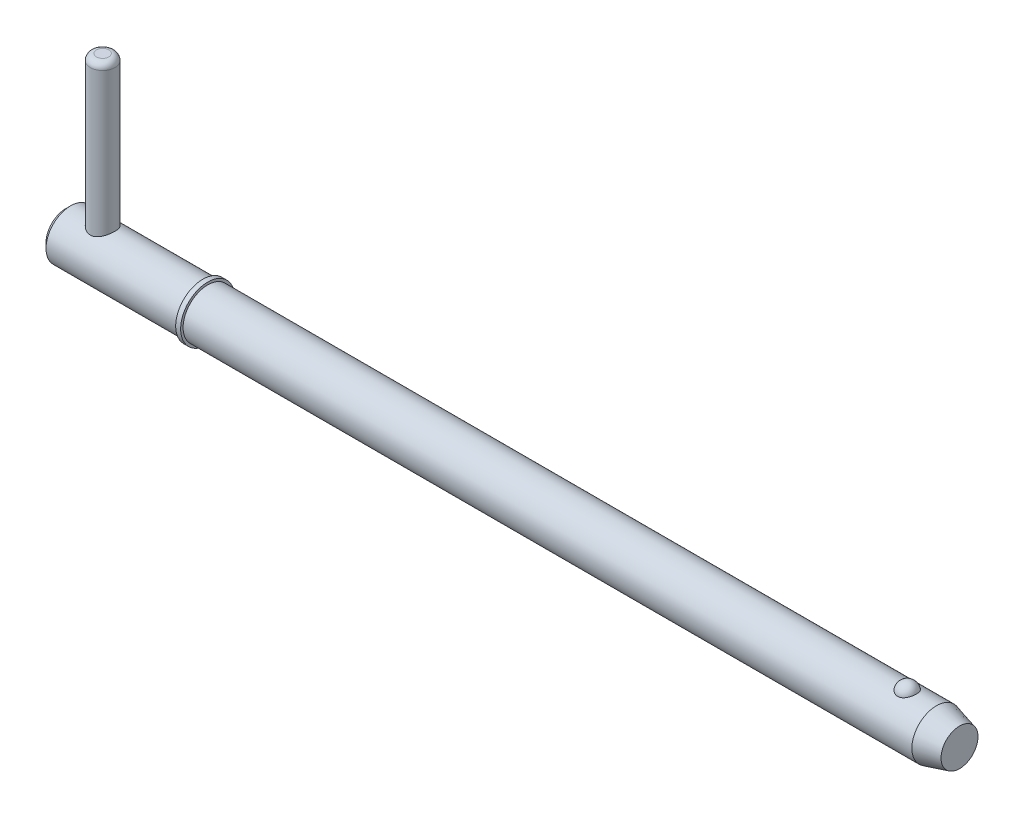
ISO-10303-21;
HEADER;
FILE_DESCRIPTION(('STEP AP214'),'2;1');
FILE_NAME('part.step','',(''),(''),'','','');
FILE_SCHEMA(('AUTOMOTIVE_DESIGN { 1 0 10303 214 1 1 1 1 }'));
ENDSEC;
DATA;
#1=APPLICATION_CONTEXT('core data for automotive mechanical design processes');
#2=APPLICATION_PROTOCOL_DEFINITION('international standard','automotive_design',2000,#1);
#3=PRODUCT_CONTEXT('',#1,'mechanical');
#4=PRODUCT('Part','Part','',(#3));
#5=PRODUCT_RELATED_PRODUCT_CATEGORY('part','',(#4));
#6=PRODUCT_DEFINITION_FORMATION('','',#4);
#7=PRODUCT_DEFINITION_CONTEXT('part definition',#1,'design');
#8=PRODUCT_DEFINITION('design','',#6,#7);
#9=PRODUCT_DEFINITION_SHAPE('','',#8);
#10=(LENGTH_UNIT() NAMED_UNIT(*) SI_UNIT(.MILLI.,.METRE.));
#11=(NAMED_UNIT(*) PLANE_ANGLE_UNIT() SI_UNIT($,.RADIAN.));
#12=(NAMED_UNIT(*) SI_UNIT($,.STERADIAN.) SOLID_ANGLE_UNIT());
#13=UNCERTAINTY_MEASURE_WITH_UNIT(LENGTH_MEASURE(1.E-05),#10,'distance_accuracy_value','');
#14=(GEOMETRIC_REPRESENTATION_CONTEXT(3) GLOBAL_UNCERTAINTY_ASSIGNED_CONTEXT((#13)) GLOBAL_UNIT_ASSIGNED_CONTEXT((#10,
#11,#12)) REPRESENTATION_CONTEXT('',''));
#15=CARTESIAN_POINT('',(0.,0.,0.));
#16=DIRECTION('',(0.,0.,1.));
#17=DIRECTION('',(1.,0.,0.));
#18=AXIS2_PLACEMENT_3D('',#15,#16,#17);
#19=CARTESIAN_POINT('',(4.755,22.225,0.));
#20=DIRECTION('',(0.,-1.,0.));
#21=DIRECTION('',(0.,0.,-1.));
#22=AXIS2_PLACEMENT_3D('',#19,#20,#21);
#23=CYLINDRICAL_SURFACE('',#22,1.585);
#24=CARTESIAN_POINT('',(4.755,-2.3825,0.));
#25=DIRECTION('',(0.,1.,0.));
#26=DIRECTION('',(0.,0.,1.));
#27=AXIS2_PLACEMENT_3D('',#24,#25,#26);
#28=CIRCLE('',#27,1.585);
#29=CARTESIAN_POINT('',(4.755,-2.3825,1.585));
#30=VERTEX_POINT('',#29);
#31=EDGE_CURVE('P0_E25',#30,#30,#28,.T.);
#32=ORIENTED_EDGE('',*,*,#31,.T.);
#33=EDGE_LOOP('',(#32));
#34=FACE_BOUND('',#33,.T.);
#35=CARTESIAN_POINT('',(4.755,21.4325,0.));
#36=DIRECTION('',(0.,1.,0.));
#37=DIRECTION('',(0.,0.,1.));
#38=AXIS2_PLACEMENT_3D('',#35,#36,#37);
#39=CIRCLE('',#38,1.585);
#40=CARTESIAN_POINT('',(4.755,21.4325,1.585));
#41=VERTEX_POINT('',#40);
#42=EDGE_CURVE('P0_E29',#41,#41,#39,.F.);
#43=ORIENTED_EDGE('',*,*,#42,.T.);
#44=EDGE_LOOP('',(#43));
#45=FACE_BOUND('',#44,.T.);
#46=ADVANCED_FACE('P0_F14',(#34,#45),#23,.T.);
#47=CARTESIAN_POINT('',(4.755,22.225,0.));
#48=DIRECTION('',(0.,1.,0.));
#49=DIRECTION('',(0.,0.,1.));
#50=AXIS2_PLACEMENT_3D('',#47,#48,#49);
#51=PLANE('',#50);
#52=CARTESIAN_POINT('',(4.755,22.225,0.));
#53=DIRECTION('',(0.,1.,0.));
#54=DIRECTION('',(0.,0.,1.));
#55=AXIS2_PLACEMENT_3D('',#52,#53,#54);
#56=CIRCLE('',#55,0.7925);
#57=CARTESIAN_POINT('',(4.755,22.225,0.7925));
#58=VERTEX_POINT('',#57);
#59=EDGE_CURVE('P0_E10',#58,#58,#56,.T.);
#60=ORIENTED_EDGE('',*,*,#59,.T.);
#61=EDGE_LOOP('',(#60));
#62=FACE_BOUND('',#61,.T.);
#63=ADVANCED_FACE('P0_F46',(#62),#51,.T.);
#64=CARTESIAN_POINT('',(4.755,-3.175,0.));
#65=DIRECTION('',(0.,1.,0.));
#66=DIRECTION('',(0.,0.,1.));
#67=AXIS2_PLACEMENT_3D('',#64,#65,#66);
#68=PLANE('',#67);
#69=CARTESIAN_POINT('',(4.755,-3.175,0.));
#70=DIRECTION('',(0.,1.,0.));
#71=DIRECTION('',(0.,0.,1.));
#72=AXIS2_PLACEMENT_3D('',#69,#70,#71);
#73=CIRCLE('',#72,0.7925);
#74=CARTESIAN_POINT('',(4.755,-3.175,0.7925));
#75=VERTEX_POINT('',#74);
#76=EDGE_CURVE('P0_E21',#75,#75,#73,.F.);
#77=ORIENTED_EDGE('',*,*,#76,.T.);
#78=EDGE_LOOP('',(#77));
#79=FACE_BOUND('',#78,.T.);
#80=ADVANCED_FACE('P0_F43',(#79),#68,.F.);
#81=CARTESIAN_POINT('',(4.755,-2.3825,0.));
#82=DIRECTION('',(0.,1.,0.));
#83=DIRECTION('',(0.,0.,1.));
#84=AXIS2_PLACEMENT_3D('',#81,#82,#83);
#85=DEGENERATE_TOROIDAL_SURFACE('',#84,0.7925,0.7925,.T.);
#86=ORIENTED_EDGE('',*,*,#76,.F.);
#87=EDGE_LOOP('',(#86));
#88=FACE_BOUND('',#87,.T.);
#89=ORIENTED_EDGE('',*,*,#31,.F.);
#90=EDGE_LOOP('',(#89));
#91=FACE_BOUND('',#90,.T.);
#92=ADVANCED_FACE('P0_F38',(#88,#91),#85,.T.);
#93=CARTESIAN_POINT('',(4.755,21.4325,0.));
#94=DIRECTION('',(0.,1.,0.));
#95=DIRECTION('',(0.,0.,1.));
#96=AXIS2_PLACEMENT_3D('',#93,#94,#95);
#97=DEGENERATE_TOROIDAL_SURFACE('',#96,0.7925,0.7925,.T.);
#98=ORIENTED_EDGE('',*,*,#42,.F.);
#99=EDGE_LOOP('',(#98));
#100=FACE_BOUND('',#99,.T.);
#101=ORIENTED_EDGE('',*,*,#59,.F.);
#102=EDGE_LOOP('',(#101));
#103=FACE_BOUND('',#102,.T.);
#104=ADVANCED_FACE('P0_F16',(#100,#103),#97,.T.);
#105=CLOSED_SHELL('',(#46,#63,#80,#92,#104));
#106=MANIFOLD_SOLID_BREP('P0_B1',#105);
#107=CARTESIAN_POINT('',(0.,0.,0.));
#108=DIRECTION('',(1.,0.,0.));
#109=DIRECTION('',(0.,0.,-1.));
#110=AXIS2_PLACEMENT_3D('',#107,#108,#109);
#111=CYLINDRICAL_SURFACE('',#110,3.175);
#112=CARTESIAN_POINT('',(112.147684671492,0.,0.));
#113=DIRECTION('',(1.,0.,0.));
#114=DIRECTION('',(0.,0.,-1.));
#115=AXIS2_PLACEMENT_3D('',#112,#113,#114);
#116=CIRCLE('',#115,3.175);
#117=CARTESIAN_POINT('',(112.147684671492,0.,-3.175));
#118=VERTEX_POINT('',#117);
#119=EDGE_CURVE('P1_E81',#118,#118,#116,.T.);
#120=ORIENTED_EDGE('',*,*,#119,.F.);
#121=EDGE_LOOP('',(#120));
#122=FACE_BOUND('',#121,.T.);
#123=CARTESIAN_POINT('',(18.29,0.,0.));
#124=DIRECTION('',(1.,0.,0.));
#125=DIRECTION('',(0.,0.,-1.));
#126=AXIS2_PLACEMENT_3D('',#123,#124,#125);
#127=CIRCLE('',#126,3.175);
#128=CARTESIAN_POINT('',(18.29,0.,-3.175));
#129=VERTEX_POINT('',#128);
#130=EDGE_CURVE('P1_E85',#129,#129,#127,.T.);
#131=ORIENTED_EDGE('',*,*,#130,.T.);
#132=EDGE_LOOP('',(#131));
#133=FACE_BOUND('',#132,.T.);
#134=CARTESIAN_POINT('',(108.37572762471,2.92898950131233,1.2254164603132));
#135=CARTESIAN_POINT('',(108.312316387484,2.92899434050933,1.22541146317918));
#136=CARTESIAN_POINT('',(108.248797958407,2.93112688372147,1.2203464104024));
#137=CARTESIAN_POINT('',(108.123530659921,2.93942752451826,1.20020949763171));
#138=CARTESIAN_POINT('',(108.061786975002,2.9456063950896,1.1851109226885));
#139=CARTESIAN_POINT('',(107.942065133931,2.96127115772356,1.14540352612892));
#140=CARTESIAN_POINT('',(107.884077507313,2.97074831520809,1.12081980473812));
#141=CARTESIAN_POINT('',(107.773194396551,2.99197584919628,1.06285154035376));
#142=CARTESIAN_POINT('',(107.720296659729,3.0037252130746,1.02947091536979));
#143=CARTESIAN_POINT('',(107.619268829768,3.02865714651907,0.953674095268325));
#144=CARTESIAN_POINT('',(107.571324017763,3.04187163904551,0.911021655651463));
#145=CARTESIAN_POINT('',(107.483036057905,3.06808741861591,0.818400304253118));
#146=CARTESIAN_POINT('',(107.442695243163,3.08108863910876,0.768429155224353));
#147=CARTESIAN_POINT('',(107.368803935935,3.10614903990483,0.660064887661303));
#148=CARTESIAN_POINT('',(107.335633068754,3.11814104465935,0.601396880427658));
#149=CARTESIAN_POINT('',(107.279119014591,3.13926931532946,0.479026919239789));
#150=CARTESIAN_POINT('',(107.255776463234,3.14840539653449,0.415324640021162));
#151=CARTESIAN_POINT('',(107.219178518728,3.16298160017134,0.283885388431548));
#152=CARTESIAN_POINT('',(107.206040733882,3.16837855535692,0.216110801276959));
#153=CARTESIAN_POINT('',(107.190567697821,3.17475386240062,0.0791367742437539));
#154=CARTESIAN_POINT('',(107.188232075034,3.17573236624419,0.00993738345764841));
#155=CARTESIAN_POINT('',(107.194388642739,3.17318075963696,-0.127420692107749));
#156=CARTESIAN_POINT('',(107.202807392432,3.16968122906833,-0.195583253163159));
#157=CARTESIAN_POINT('',(107.230175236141,3.1585790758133,-0.329413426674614));
#158=CARTESIAN_POINT('',(107.249124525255,3.15097637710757,-0.395080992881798));
#159=CARTESIAN_POINT('',(107.297205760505,3.13242485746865,-0.522180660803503));
#160=CARTESIAN_POINT('',(107.326352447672,3.12147119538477,-0.583606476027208));
#161=CARTESIAN_POINT('',(107.394235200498,3.09734973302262,-0.700436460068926));
#162=CARTESIAN_POINT('',(107.432972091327,3.08418174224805,-0.755840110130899));
#163=CARTESIAN_POINT('',(107.519477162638,3.05694884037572,-0.859404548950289));
#164=CARTESIAN_POINT('',(107.567296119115,3.04287919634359,-0.907521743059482));
#165=CARTESIAN_POINT('',(107.670735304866,3.01548927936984,-0.994758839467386));
#166=CARTESIAN_POINT('',(107.726354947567,3.0021689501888,-1.03387941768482));
#167=CARTESIAN_POINT('',(107.842809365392,2.97810316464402,-1.10126594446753));
#168=CARTESIAN_POINT('',(107.903518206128,2.96731170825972,-1.12973256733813));
#169=CARTESIAN_POINT('',(108.029371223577,2.94928934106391,-1.17598467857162));
#170=CARTESIAN_POINT('',(108.094513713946,2.94205708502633,-1.19377420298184));
#171=CARTESIAN_POINT('',(108.223856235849,2.93233065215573,-1.21746387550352));
#172=CARTESIAN_POINT('',(108.287938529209,2.92961621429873,-1.22391763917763));
#173=CARTESIAN_POINT('',(108.416337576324,2.92855752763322,-1.22644976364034));
#174=CARTESIAN_POINT('',(108.480654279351,2.93021238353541,-1.22253024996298));
#175=CARTESIAN_POINT('',(108.605523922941,2.9375685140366,-1.20474140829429));
#176=CARTESIAN_POINT('',(108.666131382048,2.94313790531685,-1.19119621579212));
#177=CARTESIAN_POINT('',(108.784110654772,2.95756226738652,-1.15491492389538));
#178=CARTESIAN_POINT('',(108.841482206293,2.96641750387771,-1.13217808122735));
#179=CARTESIAN_POINT('',(108.952769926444,2.98669918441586,-1.07755083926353));
#180=CARTESIAN_POINT('',(109.006584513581,2.9981771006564,-1.0454730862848));
#181=CARTESIAN_POINT('',(109.108147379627,3.02240235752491,-0.973220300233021));
#182=CARTESIAN_POINT('',(109.155894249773,3.03514999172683,-0.933043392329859));
#183=CARTESIAN_POINT('',(109.246581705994,3.06131230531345,-0.843372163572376));
#184=CARTESIAN_POINT('',(109.289158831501,3.07472822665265,-0.793510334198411));
#185=CARTESIAN_POINT('',(109.365676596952,3.10021106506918,-0.687241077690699));
#186=CARTESIAN_POINT('',(109.399615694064,3.1122777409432,-0.630832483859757));
#187=CARTESIAN_POINT('',(109.459120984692,3.134208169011,-0.511059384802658));
#188=CARTESIAN_POINT('',(109.484389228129,3.14399040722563,-0.447531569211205));
#189=CARTESIAN_POINT('',(109.524511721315,3.15983820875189,-0.316827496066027));
#190=CARTESIAN_POINT('',(109.539365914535,3.16590375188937,-0.249651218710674));
#191=CARTESIAN_POINT('',(109.558358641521,3.17370076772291,-0.113549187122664));
#192=CARTESIAN_POINT('',(109.562496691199,3.17543204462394,-0.0446233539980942));
#193=CARTESIAN_POINT('',(109.559969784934,3.17438372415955,0.0929938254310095));
#194=CARTESIAN_POINT('',(109.553305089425,3.17160423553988,0.16168517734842));
#195=CARTESIAN_POINT('',(109.529375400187,3.1618438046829,0.296502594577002));
#196=CARTESIAN_POINT('',(109.512167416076,3.15488546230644,0.362640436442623));
#197=CARTESIAN_POINT('',(109.467547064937,3.13748892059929,0.490896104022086));
#198=CARTESIAN_POINT('',(109.440133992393,3.12705048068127,0.553013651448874));
#199=CARTESIAN_POINT('',(109.375462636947,3.10369139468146,0.671876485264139));
#200=CARTESIAN_POINT('',(109.338146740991,3.0907563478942,0.72858760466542));
#201=CARTESIAN_POINT('',(109.254524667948,3.06381731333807,0.834653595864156));
#202=CARTESIAN_POINT('',(109.208218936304,3.04981337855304,0.884008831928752));
#203=CARTESIAN_POINT('',(109.107718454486,3.02230423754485,0.973916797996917));
#204=CARTESIAN_POINT('',(109.053535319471,3.00879833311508,1.01448227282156));
#205=CARTESIAN_POINT('',(108.938529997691,2.98383625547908,1.0857155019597));
#206=CARTESIAN_POINT('',(108.877705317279,2.9723808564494,1.11637952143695));
#207=CARTESIAN_POINT('',(108.753369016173,2.95329063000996,1.16592590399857));
#208=CARTESIAN_POINT('',(108.690023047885,2.9455373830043,1.18517901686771));
#209=CARTESIAN_POINT('',(108.56076644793,2.9342556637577,1.21284802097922));
#210=CARTESIAN_POINT('',(108.494864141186,2.93071450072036,1.2212964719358));
#211=CARTESIAN_POINT('',(108.411116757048,2.9291525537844,1.22502505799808));
#212=CARTESIAN_POINT('',(108.393426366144,2.92898815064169,1.22541785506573));
#213=CARTESIAN_POINT('',(108.37572762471,2.92898950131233,1.2254164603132));
#214=B_SPLINE_CURVE_WITH_KNOTS('',3,(#134,#135,#136,#137,#138,#139,#140,#141,#142,#143,#144,
#145,#146,#147,#148,#149,#150,#151,#152,#153,#154,#155,#156,#157,#158,#159,#160,#161,#162,#163,
#164,#165,#166,#167,#168,#169,#170,#171,#172,#173,#174,#175,#176,#177,#178,#179,#180,#181,#182,
#183,#184,#185,#186,#187,#188,#189,#190,#191,#192,#193,#194,#195,#196,#197,#198,#199,#200,#201,
#202,#203,#204,#205,#206,#207,#208,#209,#210,#211,#212,#213),.UNSPECIFIED.,.T.,.F.,(4,2,2,2,2,2,
2,2,2,2,2,2,2,2,2,2,2,2,2,2,2,2,2,2,2,2,2,2,2,2,2,2,2,2,2,2,2,2,2,4),(0.,0.190186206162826,
0.380880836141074,0.571074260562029,0.761183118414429,0.956866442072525,1.15260970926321,
1.3570177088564,1.56143892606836,1.76818248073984,1.97491892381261,2.18025109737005,
2.38558707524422,2.59122111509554,2.79687285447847,3.00371012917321,3.2105318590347,
3.41323429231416,3.61586005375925,3.80828192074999,4.00066436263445,4.18685798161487,
4.37306665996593,4.56330302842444,4.75358348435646,4.95345287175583,5.15335793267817,
5.35957003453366,5.56578325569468,5.7720057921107,5.97822335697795,6.18333558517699,
6.38846199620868,6.59480900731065,6.80114579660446,7.00718137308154,7.21329457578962,
7.41228022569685,7.61066481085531,7.66374777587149),.UNSPECIFIED.);
#215=CARTESIAN_POINT('',(108.37572762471,2.92898950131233,1.2254164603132));
#216=VERTEX_POINT('',#215);
#217=EDGE_CURVE('P1_E35',#216,#216,#214,.T.);
#218=ORIENTED_EDGE('',*,*,#217,.T.);
#219=EDGE_LOOP('',(#218));
#220=FACE_BOUND('',#219,.T.);
#221=ADVANCED_FACE('P1_F13',(#122,#133,#220),#111,.T.);
#222=CARTESIAN_POINT('',(0.,0.,0.));
#223=DIRECTION('',(-1.,0.,0.));
#224=DIRECTION('',(0.,0.,1.));
#225=AXIS2_PLACEMENT_3D('',#222,#223,#224);
#226=PLANE('',#225);
#227=CARTESIAN_POINT('',(0.,0.,0.));
#228=DIRECTION('',(1.,0.,0.));
#229=DIRECTION('',(0.,0.,-1.));
#230=AXIS2_PLACEMENT_3D('',#227,#228,#229);
#231=CIRCLE('',#230,2.54);
#232=CARTESIAN_POINT('',(0.,0.,-2.54));
#233=VERTEX_POINT('',#232);
#234=EDGE_CURVE('P1_E9',#233,#233,#231,.T.);
#235=ORIENTED_EDGE('',*,*,#234,.F.);
#236=EDGE_LOOP('',(#235));
#237=FACE_BOUND('',#236,.T.);
#238=ADVANCED_FACE('P1_F15',(#237),#226,.T.);
#239=CARTESIAN_POINT('',(0.634999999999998,0.,0.));
#240=DIRECTION('',(1.,0.,0.));
#241=DIRECTION('',(0.,0.,-1.));
#242=AXIS2_PLACEMENT_3D('',#239,#240,#241);
#243=CONICAL_SURFACE('',#242,3.175,0.78539816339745);
#244=ORIENTED_EDGE('',*,*,#234,.T.);
#245=EDGE_LOOP('',(#244));
#246=FACE_BOUND('',#245,.T.);
#247=CARTESIAN_POINT('',(0.634999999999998,0.,0.));
#248=DIRECTION('',(1.,0.,0.));
#249=DIRECTION('',(0.,0.,-1.));
#250=AXIS2_PLACEMENT_3D('',#247,#248,#249);
#251=CIRCLE('',#250,3.175);
#252=CARTESIAN_POINT('',(0.634999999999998,0.,-3.175));
#253=VERTEX_POINT('',#252);
#254=EDGE_CURVE('P1_E26',#253,#253,#251,.T.);
#255=ORIENTED_EDGE('',*,*,#254,.F.);
#256=EDGE_LOOP('',(#255));
#257=FACE_BOUND('',#256,.T.);
#258=ADVANCED_FACE('P1_F77',(#246,#257),#243,.T.);
#259=CARTESIAN_POINT('',(0.,0.,0.));
#260=DIRECTION('',(1.,0.,0.));
#261=DIRECTION('',(0.,0.,-1.));
#262=AXIS2_PLACEMENT_3D('',#259,#260,#261);
#263=CYLINDRICAL_SURFACE('',#262,3.175);
#264=CARTESIAN_POINT('',(4.755,-2.75107251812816,1.585));
#265=CARTESIAN_POINT('',(4.67238891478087,-2.7510796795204,1.58499425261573));
#266=CARTESIAN_POINT('',(4.58967306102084,-2.75485010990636,1.57849830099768));
#267=CARTESIAN_POINT('',(4.42677850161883,-2.76938647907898,1.55284486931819));
#268=CARTESIAN_POINT('',(4.34660551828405,-2.78016716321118,1.53366069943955));
#269=CARTESIAN_POINT('',(4.19146029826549,-2.80716278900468,1.48366329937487));
#270=CARTESIAN_POINT('',(4.11646293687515,-2.8233488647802,1.45291173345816));
#271=CARTESIAN_POINT('',(3.97271079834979,-2.85928672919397,1.38084067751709));
#272=CARTESIAN_POINT('',(3.90395634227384,-2.87903870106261,1.33952064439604));
#273=CARTESIAN_POINT('',(3.76839976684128,-2.921867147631,1.24350234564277));
#274=CARTESIAN_POINT('',(3.702222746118,-2.94508343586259,1.18798355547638));
#275=CARTESIAN_POINT('',(3.5796334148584,-2.99109588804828,1.06685014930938));
#276=CARTESIAN_POINT('',(3.52322596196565,-3.01389183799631,1.00123054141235));
#277=CARTESIAN_POINT('',(3.41807024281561,-3.05832598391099,0.856373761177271));
#278=CARTESIAN_POINT('',(3.37009053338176,-3.07978367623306,0.776518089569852));
#279=CARTESIAN_POINT('',(3.28853137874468,-3.11730894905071,0.608596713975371));
#280=CARTESIAN_POINT('',(3.25494287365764,-3.1333799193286,0.520536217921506));
#281=CARTESIAN_POINT('',(3.20559401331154,-3.15731341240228,0.345327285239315));
#282=CARTESIAN_POINT('',(3.18873760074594,-3.16567752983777,0.258557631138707));
#283=CARTESIAN_POINT('',(3.16972238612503,-3.17512718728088,0.0830496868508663));
#284=CARTESIAN_POINT('',(3.16755472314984,-3.17621711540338,-0.00568738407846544));
#285=CARTESIAN_POINT('',(3.1775542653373,-3.17123385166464,-0.174372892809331));
#286=CARTESIAN_POINT('',(3.18849502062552,-3.16577346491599,-0.254416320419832));
#287=CARTESIAN_POINT('',(3.22220680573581,-3.14922844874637,-0.411354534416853));
#288=CARTESIAN_POINT('',(3.2449787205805,-3.13814339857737,-0.488249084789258));
#289=CARTESIAN_POINT('',(3.30185558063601,-3.111172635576,-0.638050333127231));
#290=CARTESIAN_POINT('',(3.33611332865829,-3.09522247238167,-0.710886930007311));
#291=CARTESIAN_POINT('',(3.41477890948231,-3.05996035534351,-0.849953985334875));
#292=CARTESIAN_POINT('',(3.45919037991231,-3.04064719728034,-0.916182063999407));
#293=CARTESIAN_POINT('',(3.5617148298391,-2.99832415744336,-1.04681642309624));
#294=CARTESIAN_POINT('',(3.62072497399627,-2.97513741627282,-1.11046186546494));
#295=CARTESIAN_POINT('',(3.7483697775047,-2.92885066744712,-1.22736291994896));
#296=CARTESIAN_POINT('',(3.81701173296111,-2.90575073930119,-1.2806105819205));
#297=CARTESIAN_POINT('',(3.96727993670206,-2.86067370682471,-1.37849835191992));
#298=CARTESIAN_POINT('',(4.04945242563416,-2.83885964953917,-1.42238246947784));
#299=CARTESIAN_POINT('',(4.2213558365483,-2.80110454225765,-1.49537418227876));
#300=CARTESIAN_POINT('',(4.3110787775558,-2.78515738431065,-1.52449715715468));
#301=CARTESIAN_POINT('',(4.48806324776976,-2.76271292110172,-1.56478065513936));
#302=CARTESIAN_POINT('',(4.57495732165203,-2.75556745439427,-1.57718067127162));
#303=CARTESIAN_POINT('',(4.74985771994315,-2.74969306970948,-1.58740564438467));
#304=CARTESIAN_POINT('',(4.8378632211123,-2.75095824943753,-1.58524082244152));
#305=CARTESIAN_POINT('',(5.00227282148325,-2.76107477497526,-1.56753530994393));
#306=CARTESIAN_POINT('',(5.07889680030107,-2.76908515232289,-1.55347662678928));
#307=CARTESIAN_POINT('',(5.22855309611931,-2.79054849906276,-1.51458035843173));
#308=CARTESIAN_POINT('',(5.30158424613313,-2.80400322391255,-1.489739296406));
#309=CARTESIAN_POINT('',(5.44583114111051,-2.83556995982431,-1.42877335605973));
#310=CARTESIAN_POINT('',(5.51680600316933,-2.85386886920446,-1.39217900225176));
#311=CARTESIAN_POINT('',(5.6520174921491,-2.89289503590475,-1.30915485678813));
#312=CARTESIAN_POINT('',(5.71625063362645,-2.91362353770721,-1.26272001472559));
#313=CARTESIAN_POINT('',(5.8445938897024,-2.95830220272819,-1.15451693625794));
#314=CARTESIAN_POINT('',(5.90767560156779,-2.98233004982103,-1.09155543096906));
#315=CARTESIAN_POINT('',(6.0226995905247,-3.02864458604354,-0.955560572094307));
#316=CARTESIAN_POINT('',(6.07463814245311,-3.05093069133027,-0.882523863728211));
#317=CARTESIAN_POINT('',(6.16704288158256,-3.09200671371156,-0.725836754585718));
#318=CARTESIAN_POINT('',(6.20717458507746,-3.11069030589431,-0.64195924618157));
#319=CARTESIAN_POINT('',(6.27235859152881,-3.1416474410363,-0.467442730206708));
#320=CARTESIAN_POINT('',(6.29742409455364,-3.15392659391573,-0.376809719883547));
#321=CARTESIAN_POINT('',(6.32960989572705,-3.16979844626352,-0.200314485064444));
#322=CARTESIAN_POINT('',(6.33816324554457,-3.17408359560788,-0.114775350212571));
#323=CARTESIAN_POINT('',(6.34130309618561,-3.17565001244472,0.0566108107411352));
#324=CARTESIAN_POINT('',(6.33589445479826,-3.17293371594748,0.142457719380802));
#325=CARTESIAN_POINT('',(6.31221457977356,-3.16120608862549,0.306097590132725));
#326=CARTESIAN_POINT('',(6.2948097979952,-3.15261910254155,0.38404960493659));
#327=CARTESIAN_POINT('',(6.24879775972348,-3.13040364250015,0.535801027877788));
#328=CARTESIAN_POINT('',(6.22018889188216,-3.11677444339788,0.609599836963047));
#329=CARTESIAN_POINT('',(6.15130303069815,-3.08497808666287,0.754502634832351));
#330=CARTESIAN_POINT('',(6.11057850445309,-3.0666414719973,0.82535556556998));
#331=CARTESIAN_POINT('',(6.01917980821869,-3.02735012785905,0.95951596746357));
#332=CARTESIAN_POINT('',(5.96850106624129,-3.00639419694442,1.02281994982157));
#333=CARTESIAN_POINT('',(5.8528006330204,-2.96149402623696,1.1467073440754));
#334=CARTESIAN_POINT('',(5.78685463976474,-2.93745961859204,1.20639723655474));
#335=CARTESIAN_POINT('',(5.64552278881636,-2.89084502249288,1.31419099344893));
#336=CARTESIAN_POINT('',(5.57012871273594,-2.8682661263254,1.36228466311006));
#337=CARTESIAN_POINT('',(5.40892145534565,-2.82661780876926,1.44677201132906));
#338=CARTESIAN_POINT('',(5.32285703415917,-2.80767948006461,1.48275497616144));
#339=CARTESIAN_POINT('',(5.14469010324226,-2.77716572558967,1.53916557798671));
#340=CARTESIAN_POINT('',(5.05260892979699,-2.76556569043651,1.55964525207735));
#341=CARTESIAN_POINT('',(4.92544162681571,-2.75613775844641,1.57618070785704));
#342=CARTESIAN_POINT('',(4.89147210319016,-2.75424493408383,1.57948285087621));
#343=CARTESIAN_POINT('',(4.82334103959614,-2.75171079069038,1.58389375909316));
#344=CARTESIAN_POINT('',(4.78917948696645,-2.75106955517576,1.58500237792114));
#345=CARTESIAN_POINT('',(4.755,-2.75107251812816,1.585));
#346=B_SPLINE_CURVE_WITH_KNOTS('',3,(#264,#265,#266,#267,#268,#269,#270,#271,#272,#273,#274,
#275,#276,#277,#278,#279,#280,#281,#282,#283,#284,#285,#286,#287,#288,#289,#290,#291,#292,#293,
#294,#295,#296,#297,#298,#299,#300,#301,#302,#303,#304,#305,#306,#307,#308,#309,#310,#311,#312,
#313,#314,#315,#316,#317,#318,#319,#320,#321,#322,#323,#324,#325,#326,#327,#328,#329,#330,#331,
#332,#333,#334,#335,#336,#337,#338,#339,#340,#341,#342,#343,#344,#345),.UNSPECIFIED.,.T.,.F.,(4,
2,2,2,2,2,2,2,2,2,2,2,2,2,2,2,2,2,2,2,2,2,2,2,2,2,2,2,2,2,2,2,2,2,2,2,2,2,2,2,4),(0.,
0.247689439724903,0.495901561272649,0.742808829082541,0.989728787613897,1.25694656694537,
1.52429683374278,1.80959781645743,2.0947189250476,2.35960564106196,2.62433255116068,
2.86610932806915,3.1079041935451,3.35305262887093,3.59828902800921,3.86665310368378,
4.13522157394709,4.4207514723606,4.70598326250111,4.9686344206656,5.23110127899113,
5.46499114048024,5.69895647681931,5.94376186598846,6.1886932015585,6.46438263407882,
6.74016408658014,7.0231370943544,7.30586181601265,7.5626977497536,7.81944433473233,
8.05935987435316,8.29930993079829,8.54954401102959,8.79989329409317,9.07508848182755,
9.35052473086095,9.63453318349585,9.91758407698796,10.0200561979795,10.1225351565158),.UNSPECIFIED.);
#347=CARTESIAN_POINT('',(4.755,-2.75107251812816,1.585));
#348=VERTEX_POINT('',#347);
#349=EDGE_CURVE('P1_E17',#348,#348,#346,.T.);
#350=ORIENTED_EDGE('',*,*,#349,.F.);
#351=EDGE_LOOP('',(#350));
#352=FACE_BOUND('',#351,.T.);
#353=CARTESIAN_POINT('',(4.755,2.75107251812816,1.585));
#354=CARTESIAN_POINT('',(4.83761108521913,2.7510796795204,1.58499425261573));
#355=CARTESIAN_POINT('',(4.92032693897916,2.75485010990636,1.57849830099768));
#356=CARTESIAN_POINT('',(5.08322149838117,2.76938647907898,1.55284486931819));
#357=CARTESIAN_POINT('',(5.16339448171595,2.78016716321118,1.53366069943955));
#358=CARTESIAN_POINT('',(5.31853970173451,2.80716278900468,1.48366329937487));
#359=CARTESIAN_POINT('',(5.39353706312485,2.8233488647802,1.45291173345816));
#360=CARTESIAN_POINT('',(5.53728920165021,2.85928672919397,1.38084067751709));
#361=CARTESIAN_POINT('',(5.60604365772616,2.87903870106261,1.33952064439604));
#362=CARTESIAN_POINT('',(5.74160023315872,2.921867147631,1.24350234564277));
#363=CARTESIAN_POINT('',(5.807777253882,2.94508343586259,1.18798355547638));
#364=CARTESIAN_POINT('',(5.9303665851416,2.99109588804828,1.06685014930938));
#365=CARTESIAN_POINT('',(5.98677403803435,3.01389183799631,1.00123054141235));
#366=CARTESIAN_POINT('',(6.09192975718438,3.05832598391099,0.85637376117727));
#367=CARTESIAN_POINT('',(6.13990946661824,3.07978367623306,0.776518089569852));
#368=CARTESIAN_POINT('',(6.22146862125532,3.11730894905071,0.608596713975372));
#369=CARTESIAN_POINT('',(6.25505712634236,3.1333799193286,0.520536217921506));
#370=CARTESIAN_POINT('',(6.30440598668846,3.15731341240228,0.345327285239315));
#371=CARTESIAN_POINT('',(6.32126239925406,3.16567752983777,0.258557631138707));
#372=CARTESIAN_POINT('',(6.34027761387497,3.17512718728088,0.0830496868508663));
#373=CARTESIAN_POINT('',(6.34244527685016,3.17621711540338,-0.00568738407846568));
#374=CARTESIAN_POINT('',(6.3324457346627,3.17123385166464,-0.174372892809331));
#375=CARTESIAN_POINT('',(6.32150497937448,3.16577346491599,-0.254416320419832));
#376=CARTESIAN_POINT('',(6.28779319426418,3.14922844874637,-0.411354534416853));
#377=CARTESIAN_POINT('',(6.2650212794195,3.13814339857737,-0.488249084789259));
#378=CARTESIAN_POINT('',(6.20814441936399,3.111172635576,-0.638050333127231));
#379=CARTESIAN_POINT('',(6.17388667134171,3.09522247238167,-0.710886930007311));
#380=CARTESIAN_POINT('',(6.09522109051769,3.05996035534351,-0.849953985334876));
#381=CARTESIAN_POINT('',(6.05080962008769,3.04064719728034,-0.916182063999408));
#382=CARTESIAN_POINT('',(5.9482851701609,2.99832415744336,-1.04681642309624));
#383=CARTESIAN_POINT('',(5.88927502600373,2.97513741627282,-1.11046186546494));
#384=CARTESIAN_POINT('',(5.7616302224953,2.92885066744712,-1.22736291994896));
#385=CARTESIAN_POINT('',(5.69298826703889,2.90575073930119,-1.2806105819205));
#386=CARTESIAN_POINT('',(5.54272006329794,2.86067370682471,-1.37849835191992));
#387=CARTESIAN_POINT('',(5.46054757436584,2.83885964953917,-1.42238246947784));
#388=CARTESIAN_POINT('',(5.2886441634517,2.80110454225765,-1.49537418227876));
#389=CARTESIAN_POINT('',(5.19892122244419,2.78515738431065,-1.52449715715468));
#390=CARTESIAN_POINT('',(5.02193675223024,2.76271292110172,-1.56478065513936));
#391=CARTESIAN_POINT('',(4.93504267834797,2.75556745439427,-1.57718067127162));
#392=CARTESIAN_POINT('',(4.76014228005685,2.74969306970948,-1.58740564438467));
#393=CARTESIAN_POINT('',(4.6721367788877,2.75095824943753,-1.58524082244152));
#394=CARTESIAN_POINT('',(4.50772717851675,2.76107477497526,-1.56753530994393));
#395=CARTESIAN_POINT('',(4.43110319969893,2.76908515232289,-1.55347662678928));
#396=CARTESIAN_POINT('',(4.28144690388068,2.79054849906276,-1.51458035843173));
#397=CARTESIAN_POINT('',(4.20841575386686,2.80400322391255,-1.489739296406));
#398=CARTESIAN_POINT('',(4.06416885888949,2.83556995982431,-1.42877335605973));
#399=CARTESIAN_POINT('',(3.99319399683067,2.85386886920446,-1.39217900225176));
#400=CARTESIAN_POINT('',(3.8579825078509,2.89289503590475,-1.30915485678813));
#401=CARTESIAN_POINT('',(3.79374936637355,2.91362353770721,-1.26272001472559));
#402=CARTESIAN_POINT('',(3.6654061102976,2.95830220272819,-1.15451693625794));
#403=CARTESIAN_POINT('',(3.60232439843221,2.98233004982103,-1.09155543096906));
#404=CARTESIAN_POINT('',(3.4873004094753,3.02864458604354,-0.955560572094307));
#405=CARTESIAN_POINT('',(3.43536185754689,3.05093069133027,-0.88252386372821));
#406=CARTESIAN_POINT('',(3.34295711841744,3.09200671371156,-0.725836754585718));
#407=CARTESIAN_POINT('',(3.30282541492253,3.11069030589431,-0.64195924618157));
#408=CARTESIAN_POINT('',(3.23764140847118,3.14164744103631,-0.467442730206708));
#409=CARTESIAN_POINT('',(3.21257590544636,3.15392659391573,-0.376809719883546));
#410=CARTESIAN_POINT('',(3.18039010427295,3.16979844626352,-0.200314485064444));
#411=CARTESIAN_POINT('',(3.17183675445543,3.17408359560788,-0.114775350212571));
#412=CARTESIAN_POINT('',(3.16869690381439,3.17565001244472,0.0566108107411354));
#413=CARTESIAN_POINT('',(3.17410554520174,3.17293371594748,0.142457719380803));
#414=CARTESIAN_POINT('',(3.19778542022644,3.16120608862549,0.306097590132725));
#415=CARTESIAN_POINT('',(3.2151902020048,3.15261910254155,0.384049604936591));
#416=CARTESIAN_POINT('',(3.26120224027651,3.13040364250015,0.535801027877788));
#417=CARTESIAN_POINT('',(3.28981110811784,3.11677444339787,0.609599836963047));
#418=CARTESIAN_POINT('',(3.35869696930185,3.08497808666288,0.754502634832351));
#419=CARTESIAN_POINT('',(3.39942149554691,3.0666414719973,0.82535556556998));
#420=CARTESIAN_POINT('',(3.49082019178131,3.02735012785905,0.95951596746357));
#421=CARTESIAN_POINT('',(3.54149893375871,3.00639419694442,1.02281994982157));
#422=CARTESIAN_POINT('',(3.6571993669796,2.96149402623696,1.1467073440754));
#423=CARTESIAN_POINT('',(3.72314536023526,2.93745961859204,1.20639723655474));
#424=CARTESIAN_POINT('',(3.86447721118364,2.89084502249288,1.31419099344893));
#425=CARTESIAN_POINT('',(3.93987128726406,2.8682661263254,1.36228466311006));
#426=CARTESIAN_POINT('',(4.10107854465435,2.82661780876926,1.44677201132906));
#427=CARTESIAN_POINT('',(4.18714296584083,2.80767948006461,1.48275497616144));
#428=CARTESIAN_POINT('',(4.36530989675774,2.77716572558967,1.53916557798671));
#429=CARTESIAN_POINT('',(4.45739107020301,2.76556569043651,1.55964525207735));
#430=CARTESIAN_POINT('',(4.58455837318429,2.75613775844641,1.57618070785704));
#431=CARTESIAN_POINT('',(4.61852789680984,2.75424493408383,1.57948285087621));
#432=CARTESIAN_POINT('',(4.68665896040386,2.75171079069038,1.58389375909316));
#433=CARTESIAN_POINT('',(4.72082051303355,2.75106955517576,1.58500237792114));
#434=CARTESIAN_POINT('',(4.755,2.75107251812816,1.585));
#435=B_SPLINE_CURVE_WITH_KNOTS('',3,(#353,#354,#355,#356,#357,#358,#359,#360,#361,#362,#363,
#364,#365,#366,#367,#368,#369,#370,#371,#372,#373,#374,#375,#376,#377,#378,#379,#380,#381,#382,
#383,#384,#385,#386,#387,#388,#389,#390,#391,#392,#393,#394,#395,#396,#397,#398,#399,#400,#401,
#402,#403,#404,#405,#406,#407,#408,#409,#410,#411,#412,#413,#414,#415,#416,#417,#418,#419,#420,
#421,#422,#423,#424,#425,#426,#427,#428,#429,#430,#431,#432,#433,#434),.UNSPECIFIED.,.T.,.F.,(4,
2,2,2,2,2,2,2,2,2,2,2,2,2,2,2,2,2,2,2,2,2,2,2,2,2,2,2,2,2,2,2,2,2,2,2,2,2,2,2,4),(0.,
0.247689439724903,0.495901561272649,0.742808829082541,0.989728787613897,1.25694656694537,
1.52429683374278,1.80959781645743,2.0947189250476,2.35960564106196,2.62433255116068,
2.86610932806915,3.1079041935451,3.35305262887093,3.59828902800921,3.86665310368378,
4.13522157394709,4.4207514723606,4.70598326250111,4.9686344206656,5.23110127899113,
5.46499114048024,5.69895647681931,5.94376186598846,6.1886932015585,6.46438263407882,
6.74016408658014,7.0231370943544,7.30586181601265,7.5626977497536,7.81944433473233,
8.05935987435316,8.29930993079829,8.54954401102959,8.79989329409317,9.07508848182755,
9.35052473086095,9.63453318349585,9.91758407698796,10.0200561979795,10.1225351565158),.UNSPECIFIED.);
#436=CARTESIAN_POINT('',(4.755,2.75107251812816,1.585));
#437=VERTEX_POINT('',#436);
#438=EDGE_CURVE('P1_E43',#437,#437,#435,.T.);
#439=ORIENTED_EDGE('',*,*,#438,.F.);
#440=EDGE_LOOP('',(#439));
#441=FACE_BOUND('',#440,.T.);
#442=ORIENTED_EDGE('',*,*,#254,.T.);
#443=EDGE_LOOP('',(#442));
#444=FACE_BOUND('',#443,.T.);
#445=CARTESIAN_POINT('',(17.655,0.,0.));
#446=DIRECTION('',(1.,0.,0.));
#447=DIRECTION('',(0.,0.,-1.));
#448=AXIS2_PLACEMENT_3D('',#445,#446,#447);
#449=CIRCLE('',#448,3.175);
#450=CARTESIAN_POINT('',(17.655,0.,-3.175));
#451=VERTEX_POINT('',#450);
#452=EDGE_CURVE('P1_E31',#451,#451,#449,.T.);
#453=ORIENTED_EDGE('',*,*,#452,.F.);
#454=EDGE_LOOP('',(#453));
#455=FACE_BOUND('',#454,.T.);
#456=ADVANCED_FACE('P1_F103',(#352,#441,#444,#455),#263,.T.);
#457=CARTESIAN_POINT('',(17.655,3.175,0.));
#458=DIRECTION('',(-1.,0.,0.));
#459=DIRECTION('',(0.,0.,1.));
#460=AXIS2_PLACEMENT_3D('',#457,#458,#459);
#461=PLANE('',#460);
#462=ORIENTED_EDGE('',*,*,#452,.T.);
#463=EDGE_LOOP('',(#462));
#464=FACE_BOUND('',#463,.T.);
#465=CARTESIAN_POINT('',(17.655,0.,0.));
#466=DIRECTION('',(1.,0.,0.));
#467=DIRECTION('',(0.,0.,-1.));
#468=AXIS2_PLACEMENT_3D('',#465,#466,#467);
#469=CIRCLE('',#468,3.4925);
#470=CARTESIAN_POINT('',(17.655,0.,-3.4925));
#471=VERTEX_POINT('',#470);
#472=EDGE_CURVE('P1_E91',#471,#471,#469,.T.);
#473=ORIENTED_EDGE('',*,*,#472,.F.);
#474=EDGE_LOOP('',(#473));
#475=FACE_BOUND('',#474,.T.);
#476=ADVANCED_FACE('P1_F100',(#464,#475),#461,.T.);
#477=CARTESIAN_POINT('',(0.,0.,0.));
#478=DIRECTION('',(1.,0.,0.));
#479=DIRECTION('',(0.,0.,-1.));
#480=AXIS2_PLACEMENT_3D('',#477,#478,#479);
#481=CYLINDRICAL_SURFACE('',#480,3.4925);
#482=ORIENTED_EDGE('',*,*,#472,.T.);
#483=EDGE_LOOP('',(#482));
#484=FACE_BOUND('',#483,.T.);
#485=CARTESIAN_POINT('',(18.29,0.,0.));
#486=DIRECTION('',(1.,0.,0.));
#487=DIRECTION('',(0.,0.,-1.));
#488=AXIS2_PLACEMENT_3D('',#485,#486,#487);
#489=CIRCLE('',#488,3.4925);
#490=CARTESIAN_POINT('',(18.29,0.,-3.4925));
#491=VERTEX_POINT('',#490);
#492=EDGE_CURVE('P1_E88',#491,#491,#489,.T.);
#493=ORIENTED_EDGE('',*,*,#492,.F.);
#494=EDGE_LOOP('',(#493));
#495=FACE_BOUND('',#494,.T.);
#496=ADVANCED_FACE('P1_F68',(#484,#495),#481,.T.);
#497=CARTESIAN_POINT('',(18.29,3.4925,0.));
#498=DIRECTION('',(1.,0.,0.));
#499=DIRECTION('',(0.,0.,-1.));
#500=AXIS2_PLACEMENT_3D('',#497,#498,#499);
#501=PLANE('',#500);
#502=ORIENTED_EDGE('',*,*,#492,.T.);
#503=EDGE_LOOP('',(#502));
#504=FACE_BOUND('',#503,.T.);
#505=ORIENTED_EDGE('',*,*,#130,.F.);
#506=EDGE_LOOP('',(#505));
#507=FACE_BOUND('',#506,.T.);
#508=ADVANCED_FACE('P1_F62',(#504,#507),#501,.T.);
#509=CARTESIAN_POINT('',(115.11,0.,0.));
#510=DIRECTION('',(-1.,0.,0.));
#511=DIRECTION('',(0.,0.,1.));
#512=AXIS2_PLACEMENT_3D('',#509,#510,#511);
#513=CONICAL_SURFACE('',#512,2.38125000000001,0.261799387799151);
#514=ORIENTED_EDGE('',*,*,#119,.T.);
#515=EDGE_LOOP('',(#514));
#516=FACE_BOUND('',#515,.T.);
#517=CARTESIAN_POINT('',(115.11,0.,0.));
#518=DIRECTION('',(1.,0.,0.));
#519=DIRECTION('',(0.,0.,-1.));
#520=AXIS2_PLACEMENT_3D('',#517,#518,#519);
#521=CIRCLE('',#520,2.38125000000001);
#522=CARTESIAN_POINT('',(115.11,0.,-2.38125000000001));
#523=VERTEX_POINT('',#522);
#524=EDGE_CURVE('P1_E42',#523,#523,#521,.T.);
#525=ORIENTED_EDGE('',*,*,#524,.F.);
#526=EDGE_LOOP('',(#525));
#527=FACE_BOUND('',#526,.T.);
#528=ADVANCED_FACE('P1_F59',(#516,#527),#513,.T.);
#529=CARTESIAN_POINT('',(115.11,2.38125000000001,0.));
#530=DIRECTION('',(1.,0.,0.));
#531=DIRECTION('',(0.,0.,-1.));
#532=AXIS2_PLACEMENT_3D('',#529,#530,#531);
#533=PLANE('',#532);
#534=ORIENTED_EDGE('',*,*,#524,.T.);
#535=EDGE_LOOP('',(#534));
#536=FACE_BOUND('',#535,.T.);
#537=ADVANCED_FACE('P1_F55',(#536),#533,.T.);
#538=CARTESIAN_POINT('',(108.37572762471,2.8575,0.));
#539=DIRECTION('',(-1.,0.,0.));
#540=DIRECTION('',(0.,1.,0.));
#541=AXIS2_PLACEMENT_3D('',#538,#539,#540);
#542=SPHERICAL_SURFACE('',#541,1.22750000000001);
#543=ORIENTED_EDGE('',*,*,#217,.F.);
#544=EDGE_LOOP('',(#543));
#545=FACE_BOUND('',#544,.T.);
#546=ADVANCED_FACE('P1_F50',(#545),#542,.T.);
#547=CARTESIAN_POINT('',(4.755,-3.4925,0.));
#548=DIRECTION('',(0.,1.,0.));
#549=DIRECTION('',(0.,0.,1.));
#550=AXIS2_PLACEMENT_3D('',#547,#548,#549);
#551=CYLINDRICAL_SURFACE('',#550,1.585);
#552=ORIENTED_EDGE('',*,*,#349,.T.);
#553=EDGE_LOOP('',(#552));
#554=FACE_BOUND('',#553,.T.);
#555=ORIENTED_EDGE('',*,*,#438,.T.);
#556=EDGE_LOOP('',(#555));
#557=FACE_BOUND('',#556,.T.);
#558=ADVANCED_FACE('P1_F54',(#554,#557),#551,.F.);
#559=CLOSED_SHELL('',(#221,#238,#258,#456,#476,#496,#508,#528,#537,#546,#558));
#560=MANIFOLD_SOLID_BREP('P1_B1',#559);
#561=ADVANCED_BREP_SHAPE_REPRESENTATION('',(#18,#106,#560),#14);
#562=SHAPE_DEFINITION_REPRESENTATION(#9,#561);
ENDSEC;
END-ISO-10303-21;
